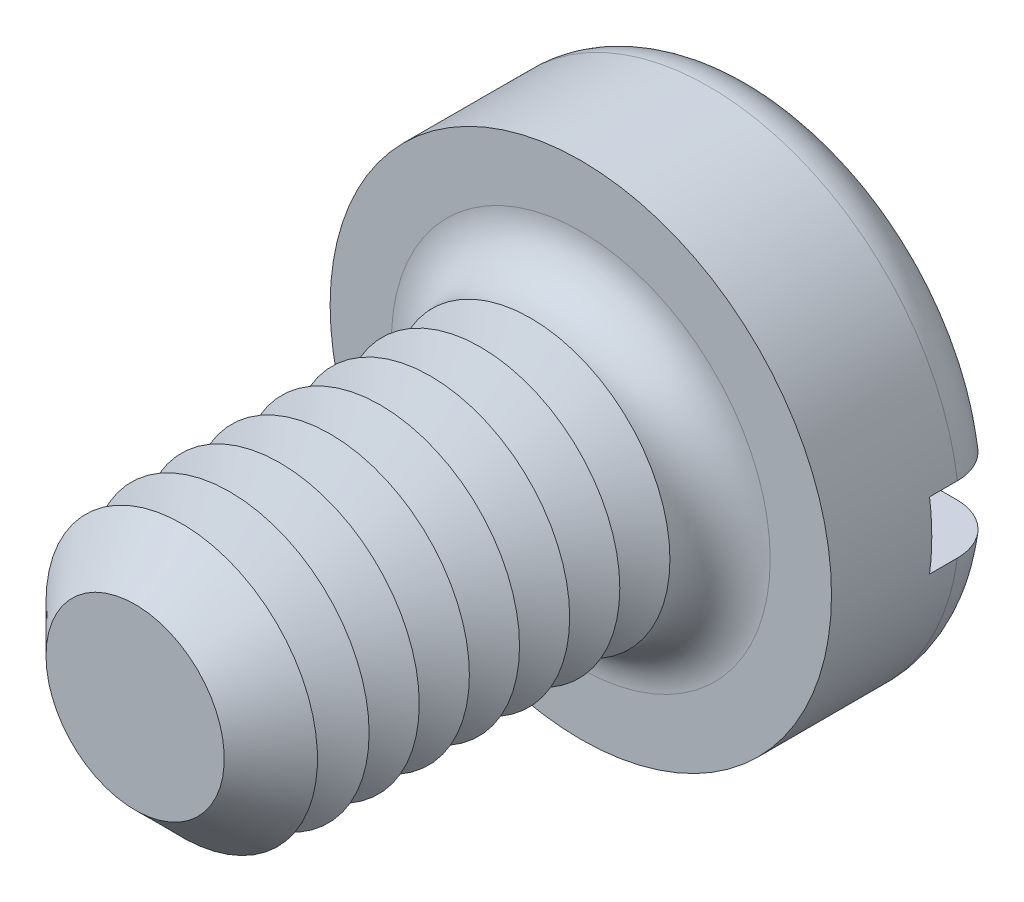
from build123d import *

# Parameters (mm, degrees)
SKETCH3_R           = 2.25
BOSS_EXTRUDE2_DEPTH = 1.6
SKETCH4_R           = 1.25
BOSS_EXTRUDE3_DEPTH = 4
FILLET1_R           = 0.45
CHAMFER1_SIZE       = 0.45
LPATTERN1_COUNT     = 7
LPATTERN1_PITCH     = 0.45
SKETCH8_W           = 4.5
SKETCH8_H           = 0.6
CUT_EXTRUDE1_DEPTH  = 0.7


with BuildPart() as part:
    # Sketch3 → Boss-Extrude2 (new body)
    with BuildSketch(Plane.XY):
        Circle(SKETCH3_R)
    extrude(amount=-BOSS_EXTRUDE2_DEPTH)

    # Sketch4 → Boss-Extrude3 (add)
    with BuildSketch(Plane.XY):
        Circle(SKETCH4_R)
    extrude(amount=BOSS_EXTRUDE3_DEPTH)

    # Fillet1
    fillet1_edges = [part.edges().sort_by_distance(p)[0] for p in [
        (-2.25, 0, -1.6),
        (-1.25, 0, 0),
    ]]
    fillet(fillet1_edges, radius=FILLET1_R)

    # Chamfer1
    chamfer1_edges = [part.edges().sort_by_distance(p)[0] for p in [
        (-1.25, 0, 4),
    ]]
    chamfer(chamfer1_edges, length=CHAMFER1_SIZE)

    # Sketch6 → Cut-Revolve1 (revolve, cut)
    with BuildSketch(Plane(origin=(0, 0, 0), x_dir=(0, 0, -1), z_dir=(1, 0, 0)), mode=Mode.PRIVATE) as cut_revolve1_sk:
        Polygon((-0.45, 1.25), (-0.675, 0.860288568), (-0.9, 1.25), align=None)
    cut_revolve1 = revolve(cut_revolve1_sk.sketch.rotate(Axis((0, 0, -1.694361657), (0, 0, 1)), 90), axis=Axis((0, 0, -1.694361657), (0, 0, 1)), mode=Mode.SUBTRACT)

    # LPattern1: Cut-Revolve1 ×7
    with Locations(*[(0, 0, i * LPATTERN1_PITCH) for i in range(1, LPATTERN1_COUNT)]):
        add(cut_revolve1, mode=Mode.SUBTRACT)

    # Sketch8 → Cut-Extrude1 (cut)
    with BuildSketch(Plane(origin=(0, 0, -1.6), x_dir=(-1, 0, 0), z_dir=(0, 0, -1))):
        Rectangle(SKETCH8_W, SKETCH8_H)
    extrude(amount=-CUT_EXTRUDE1_DEPTH, mode=Mode.SUBTRACT)


solid = part.part
